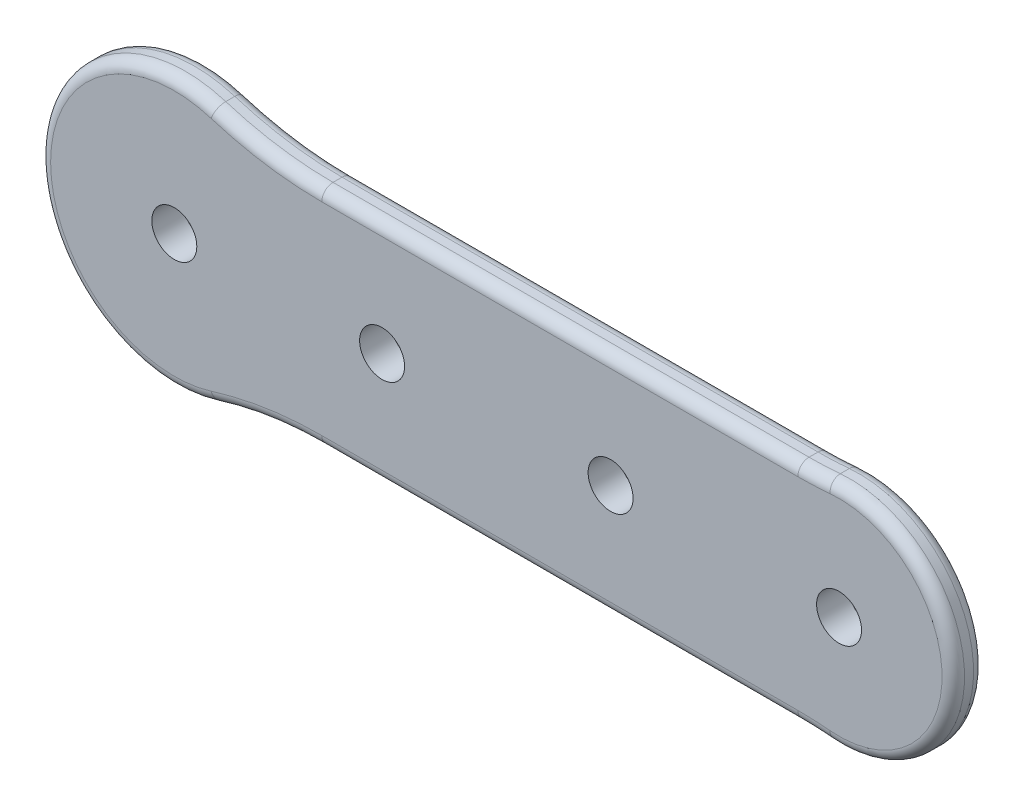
from build123d import *

# Parameters (mm, degrees)
SKETCH1_R           = 5
BOSS_EXTRUDE1_DEPTH = 7
FILLET1_R           = 80
FILLET2_R           = 2.5


with BuildPart() as part:
    # Sketch1 → Boss-Extrude1 (new body)
    # profile 1 of 9: a face of its own
    with BuildSketch(Plane.XY):
        with BuildLine():
            Line((69.410011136, 25), (-57.316876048, 25))
            ThreePointArc((-57.316876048, 25), (-47.466179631, 14.186371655), (-43.9, 0))
            ThreePointArc((-43.9, 0), (-47.466179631, -14.186371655), (-57.316876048, -25))
            Line((-57.316876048, -25), (69.410011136, -25))
            ThreePointArc((69.410011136, -25), (48.5, 0), (69.410011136, 25))
        make_face()
        with Locations((-27.7, 0)):
            Circle(SKETCH1_R, mode=Mode.SUBTRACT)
        with Locations((23.1, 0)):
            Circle(SKETCH1_R, mode=Mode.SUBTRACT)
    # profile 2 of 9: a face of its own
    with BuildSketch(Plane.XY):
        with BuildLine():
            ThreePointArc((99.3, 0), (90.195924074, 19.483399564), (69.410011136, 25))
            Line((69.410011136, 25), (73.9, 25))
            Line((73.9, 25), (73.9, 5))
            ThreePointArc((73.9, 5), (77.435533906, 3.535533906), (78.9, 0))
            ThreePointArc((78.9, 0), (77.435533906, -3.535533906), (73.9, -5))
            Line((73.9, -5), (73.9, -25))
            Line((73.9, -25), (69.410011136, -25))
            ThreePointArc((69.410011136, -25), (90.195924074, -19.483399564), (99.3, 0))
        make_face()
    # profile 3 of 9: a face of its own
    with BuildSketch(Plane.XY):
        with BuildLine():
            Line((73.9, 25), (69.410011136, 25))
            ThreePointArc((69.410011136, 25), (48.5, 0), (69.410011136, -25))
            Line((69.410011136, -25), (73.9, -25))
            Line((73.9, -25), (73.9, -5))
            ThreePointArc((73.9, -5), (68.9, 0), (73.9, 5))
            Line((73.9, 5), (73.9, 25))
        make_face()
    # profile 4 of 9: a face of its own
    with BuildSketch(Plane.XY):
        with BuildLine():
            ThreePointArc((99.3, 0), (90.195924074, 19.483399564), (69.410011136, 25))
            Line((69.410011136, 25), (73.9, 25))
            Line((73.9, 25), (73.9, 5))
            ThreePointArc((73.9, 5), (77.435533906, 3.535533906), (78.9, 0))
            ThreePointArc((78.9, 0), (77.435533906, -3.535533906), (73.9, -5))
            Line((73.9, -5), (73.9, -25))
            Line((73.9, -25), (69.410011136, -25))
            ThreePointArc((69.410011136, -25), (90.195924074, -19.483399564), (99.3, 0))
        make_face()
    # profile 5 of 9: a face of its own
    with BuildSketch(Plane.XY):
        with BuildLine():
            Line((73.9, 25), (69.410011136, 25))
            ThreePointArc((69.410011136, 25), (48.5, 0), (69.410011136, -25))
            Line((69.410011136, -25), (73.9, -25))
            Line((73.9, -25), (73.9, -5))
            ThreePointArc((73.9, -5), (68.9, 0), (73.9, 5))
            Line((73.9, 5), (73.9, 25))
        make_face()
    # profile 6 of 9: a face of its own
    with BuildSketch(Plane.XY):
        with BuildLine():
            Line((-73.9, 5), (-73.9, 25))
            Line((-73.9, 25), (-57.316876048, 25))
            ThreePointArc((-57.316876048, 25), (-103.9, 0), (-57.316876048, -25))
            Line((-57.316876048, -25), (-73.9, -25))
            Line((-73.9, -25), (-73.9, -5))
            ThreePointArc((-73.9, -5), (-78.9, 0), (-73.9, 5))
        make_face()
    # profile 7 of 9: a face of its own
    with BuildSketch(Plane.XY):
        with BuildLine():
            Line((-57.316876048, 25), (-73.9, 25))
            Line((-73.9, 25), (-73.9, 5))
            ThreePointArc((-73.9, 5), (-70.364466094, 3.535533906), (-68.9, 0))
            ThreePointArc((-68.9, 0), (-70.364466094, -3.535533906), (-73.9, -5))
            Line((-73.9, -5), (-73.9, -25))
            Line((-73.9, -25), (-57.316876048, -25))
            ThreePointArc((-57.316876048, -25), (-47.466179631, -14.186371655), (-43.9, 0))
            ThreePointArc((-43.9, 0), (-47.466179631, 14.186371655), (-57.316876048, 25))
        make_face()
    # profile 8 of 9: a face of its own
    with BuildSketch(Plane.XY):
        with BuildLine():
            Line((-73.9, 5), (-73.9, 25))
            Line((-73.9, 25), (-57.316876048, 25))
            ThreePointArc((-57.316876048, 25), (-103.9, 0), (-57.316876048, -25))
            Line((-57.316876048, -25), (-73.9, -25))
            Line((-73.9, -25), (-73.9, -5))
            ThreePointArc((-73.9, -5), (-78.9, 0), (-73.9, 5))
        make_face()
    # profile 9 of 9: a face of its own
    with BuildSketch(Plane.XY):
        with BuildLine():
            Line((-57.316876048, 25), (-73.9, 25))
            Line((-73.9, 25), (-73.9, 5))
            ThreePointArc((-73.9, 5), (-70.364466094, 3.535533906), (-68.9, 0))
            ThreePointArc((-68.9, 0), (-70.364466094, -3.535533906), (-73.9, -5))
            Line((-73.9, -5), (-73.9, -25))
            Line((-73.9, -25), (-57.316876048, -25))
            ThreePointArc((-57.316876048, -25), (-47.466179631, -14.186371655), (-43.9, 0))
            ThreePointArc((-43.9, 0), (-47.466179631, 14.186371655), (-57.316876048, 25))
        make_face()
    extrude(amount=BOSS_EXTRUDE1_DEPTH)

    # Fillet1
    fillet1_edges = [part.edges().sort_by_distance(p)[0] for p in [
        (-57.316876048, 25, 3.5),
        (69.410011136, 25, 3.5),
        (69.410011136, -25, 3.5),
        (-57.316876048, -25, 3.5),
    ]]
    fillet(fillet1_edges, radius=FILLET1_R)

    # Fillet2
    fillet2_edges = [part.edges().sort_by_distance(p)[0] for p in [
        (99.3, 0, 0),
        (99.3, 0, 7),
        (11.806658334, -25, 0),
        (11.806658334, -25, 7),
        (11.806658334, 25, 0),
        (11.806658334, 25, 7),
        (-103.9, 0, 0),
        (-103.9, 0, 7),
        (68.210978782, -25.075937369, 0),
        (68.210978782, -25.075937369, 7),
        (68.210978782, 25.075937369, 0),
        (68.210978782, 25.075937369, 7),
        (-53.173261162, -25.914315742, 0),
        (-53.173261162, -25.914315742, 7),
        (-53.173261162, 25.914315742, 0),
        (-53.173261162, 25.914315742, 7),
    ]]
    fillet(fillet2_edges, radius=FILLET2_R)


solid = part.part
